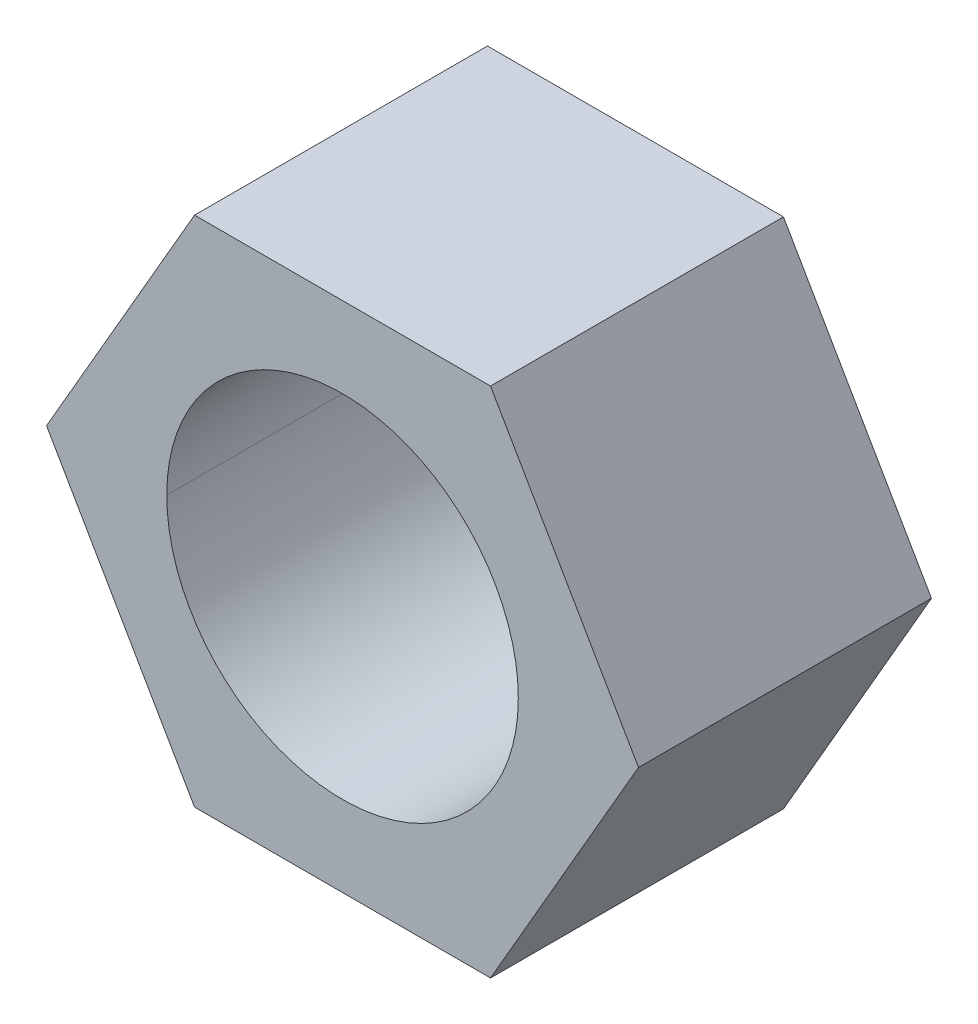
ISO-10303-21;
HEADER;
FILE_DESCRIPTION(('STEP AP214'),'2;1');
FILE_NAME('part.step','',(''),(''),'','','');
FILE_SCHEMA(('AUTOMOTIVE_DESIGN { 1 0 10303 214 1 1 1 1 }'));
ENDSEC;
DATA;
#1=APPLICATION_CONTEXT('core data for automotive mechanical design processes');
#2=APPLICATION_PROTOCOL_DEFINITION('international standard','automotive_design',2000,#1);
#3=PRODUCT_CONTEXT('',#1,'mechanical');
#4=PRODUCT('Part','Part','',(#3));
#5=PRODUCT_RELATED_PRODUCT_CATEGORY('part','',(#4));
#6=PRODUCT_DEFINITION_FORMATION('','',#4);
#7=PRODUCT_DEFINITION_CONTEXT('part definition',#1,'design');
#8=PRODUCT_DEFINITION('design','',#6,#7);
#9=PRODUCT_DEFINITION_SHAPE('','',#8);
#10=(LENGTH_UNIT() NAMED_UNIT(*) SI_UNIT(.MILLI.,.METRE.));
#11=(NAMED_UNIT(*) PLANE_ANGLE_UNIT() SI_UNIT($,.RADIAN.));
#12=(NAMED_UNIT(*) SI_UNIT($,.STERADIAN.) SOLID_ANGLE_UNIT());
#13=UNCERTAINTY_MEASURE_WITH_UNIT(LENGTH_MEASURE(1.E-05),#10,'distance_accuracy_value','');
#14=(GEOMETRIC_REPRESENTATION_CONTEXT(3) GLOBAL_UNCERTAINTY_ASSIGNED_CONTEXT((#13)) GLOBAL_UNIT_ASSIGNED_CONTEXT((#10,
#11,#12)) REPRESENTATION_CONTEXT('',''));
#15=CARTESIAN_POINT('',(0.,0.,0.));
#16=DIRECTION('',(0.,0.,1.));
#17=DIRECTION('',(1.,0.,0.));
#18=AXIS2_PLACEMENT_3D('',#15,#16,#17);
#19=CARTESIAN_POINT('',(-32.0790243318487,0.,-15.875));
#20=DIRECTION('',(-0.866025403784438,0.500000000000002,0.));
#21=DIRECTION('',(-0.500000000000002,-0.866025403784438,0.));
#22=AXIS2_PLACEMENT_3D('',#19,#20,#21);
#23=PLANE('',#22);
#24=DIRECTION('',(0.500000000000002,0.866025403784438,0.));
#25=VECTOR('',#24,1.);
#26=CARTESIAN_POINT('',(-32.0790243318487,0.,-15.875));
#27=LINE('',#26,#25);
#28=CARTESIAN_POINT('',(-32.0790243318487,0.,-15.875));
#29=VERTEX_POINT('',#28);
#30=CARTESIAN_POINT('',(-16.0395121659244,27.78125,-15.875));
#31=VERTEX_POINT('',#30);
#32=EDGE_CURVE('E109',#29,#31,#27,.T.);
#33=ORIENTED_EDGE('',*,*,#32,.F.);
#34=DIRECTION('',(0.,0.,1.));
#35=VECTOR('',#34,1.);
#36=CARTESIAN_POINT('',(-32.0790243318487,0.,-15.875));
#37=LINE('',#36,#35);
#38=CARTESIAN_POINT('',(-32.0790243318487,0.,15.875));
#39=VERTEX_POINT('',#38);
#40=EDGE_CURVE('E98',#39,#29,#37,.F.);
#41=ORIENTED_EDGE('',*,*,#40,.F.);
#42=DIRECTION('',(0.500000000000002,0.866025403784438,0.));
#43=VECTOR('',#42,1.);
#44=CARTESIAN_POINT('',(-32.0790243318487,0.,15.875));
#45=LINE('',#44,#43);
#46=CARTESIAN_POINT('',(-16.0395121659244,27.78125,15.875));
#47=VERTEX_POINT('',#46);
#48=EDGE_CURVE('E117',#39,#47,#45,.T.);
#49=ORIENTED_EDGE('',*,*,#48,.T.);
#50=DIRECTION('',(0.,0.,1.));
#51=VECTOR('',#50,1.);
#52=CARTESIAN_POINT('',(-16.0395121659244,27.78125,-15.875));
#53=LINE('',#52,#51);
#54=EDGE_CURVE('E135',#31,#47,#53,.T.);
#55=ORIENTED_EDGE('',*,*,#54,.F.);
#56=EDGE_LOOP('',(#33,#41,#49,#55));
#57=FACE_BOUND('',#56,.T.);
#58=ADVANCED_FACE('F16',(#57),#23,.T.);
#59=CARTESIAN_POINT('',(-16.0395121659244,27.78125,-15.875));
#60=DIRECTION('',(0.,1.,0.));
#61=DIRECTION('',(0.,0.,1.));
#62=AXIS2_PLACEMENT_3D('',#59,#60,#61);
#63=PLANE('',#62);
#64=DIRECTION('',(-1.,0.,0.));
#65=VECTOR('',#64,1.);
#66=CARTESIAN_POINT('',(-7.21911419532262E-13,27.78125,-15.875));
#67=LINE('',#66,#65);
#68=CARTESIAN_POINT('',(16.0395121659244,27.78125,-15.875));
#69=VERTEX_POINT('',#68);
#70=EDGE_CURVE('E107',#31,#69,#67,.F.);
#71=ORIENTED_EDGE('',*,*,#70,.F.);
#72=ORIENTED_EDGE('',*,*,#54,.T.);
#73=DIRECTION('',(-1.,0.,0.));
#74=VECTOR('',#73,1.);
#75=CARTESIAN_POINT('',(-16.0395121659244,27.78125,15.875));
#76=LINE('',#75,#74);
#77=CARTESIAN_POINT('',(16.0395121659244,27.78125,15.875));
#78=VERTEX_POINT('',#77);
#79=EDGE_CURVE('E111',#47,#78,#76,.F.);
#80=ORIENTED_EDGE('',*,*,#79,.T.);
#81=DIRECTION('',(0.,0.,1.));
#82=VECTOR('',#81,1.);
#83=CARTESIAN_POINT('',(16.0395121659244,27.78125,-15.875));
#84=LINE('',#83,#82);
#85=EDGE_CURVE('E133',#69,#78,#84,.T.);
#86=ORIENTED_EDGE('',*,*,#85,.F.);
#87=EDGE_LOOP('',(#71,#72,#80,#86));
#88=FACE_BOUND('',#87,.T.);
#89=ADVANCED_FACE('F205',(#88),#63,.T.);
#90=CARTESIAN_POINT('',(16.0395121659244,27.78125,-15.875));
#91=DIRECTION('',(0.866025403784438,0.500000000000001,0.));
#92=DIRECTION('',(-0.500000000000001,0.866025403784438,0.));
#93=AXIS2_PLACEMENT_3D('',#90,#91,#92);
#94=PLANE('',#93);
#95=DIRECTION('',(0.500000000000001,-0.866025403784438,0.));
#96=VECTOR('',#95,1.);
#97=CARTESIAN_POINT('',(16.0395121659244,27.78125,-15.875));
#98=LINE('',#97,#96);
#99=CARTESIAN_POINT('',(32.0790243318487,0.,-15.875));
#100=VERTEX_POINT('',#99);
#101=EDGE_CURVE('E105',#69,#100,#98,.T.);
#102=ORIENTED_EDGE('',*,*,#101,.F.);
#103=ORIENTED_EDGE('',*,*,#85,.T.);
#104=DIRECTION('',(0.500000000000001,-0.866025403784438,0.));
#105=VECTOR('',#104,1.);
#106=CARTESIAN_POINT('',(16.0395121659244,27.78125,15.875));
#107=LINE('',#106,#105);
#108=CARTESIAN_POINT('',(32.0790243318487,0.,15.875));
#109=VERTEX_POINT('',#108);
#110=EDGE_CURVE('E97',#78,#109,#107,.T.);
#111=ORIENTED_EDGE('',*,*,#110,.T.);
#112=DIRECTION('',(0.,0.,1.));
#113=VECTOR('',#112,1.);
#114=CARTESIAN_POINT('',(32.0790243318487,0.,-15.875));
#115=LINE('',#114,#113);
#116=EDGE_CURVE('E131',#100,#109,#115,.T.);
#117=ORIENTED_EDGE('',*,*,#116,.F.);
#118=EDGE_LOOP('',(#102,#103,#111,#117));
#119=FACE_BOUND('',#118,.T.);
#120=ADVANCED_FACE('F197',(#119),#94,.T.);
#121=CARTESIAN_POINT('',(32.0790243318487,0.,-15.875));
#122=DIRECTION('',(0.866025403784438,-0.500000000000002,0.));
#123=DIRECTION('',(0.500000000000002,0.866025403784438,0.));
#124=AXIS2_PLACEMENT_3D('',#121,#122,#123);
#125=PLANE('',#124);
#126=DIRECTION('',(-0.500000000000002,-0.866025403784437,0.));
#127=VECTOR('',#126,1.);
#128=CARTESIAN_POINT('',(32.0790243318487,0.,-15.875));
#129=LINE('',#128,#127);
#130=CARTESIAN_POINT('',(16.0395121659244,-27.78125,-15.875));
#131=VERTEX_POINT('',#130);
#132=EDGE_CURVE('E85',#100,#131,#129,.T.);
#133=ORIENTED_EDGE('',*,*,#132,.F.);
#134=ORIENTED_EDGE('',*,*,#116,.T.);
#135=DIRECTION('',(-0.500000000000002,-0.866025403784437,0.));
#136=VECTOR('',#135,1.);
#137=CARTESIAN_POINT('',(32.0790243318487,0.,15.875));
#138=LINE('',#137,#136);
#139=CARTESIAN_POINT('',(16.0395121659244,-27.78125,15.875));
#140=VERTEX_POINT('',#139);
#141=EDGE_CURVE('E123',#109,#140,#138,.T.);
#142=ORIENTED_EDGE('',*,*,#141,.T.);
#143=DIRECTION('',(0.,0.,1.));
#144=VECTOR('',#143,1.);
#145=CARTESIAN_POINT('',(16.0395121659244,-27.78125,-15.875));
#146=LINE('',#145,#144);
#147=EDGE_CURVE('E129',#131,#140,#146,.T.);
#148=ORIENTED_EDGE('',*,*,#147,.F.);
#149=EDGE_LOOP('',(#133,#134,#142,#148));
#150=FACE_BOUND('',#149,.T.);
#151=ADVANCED_FACE('F190',(#150),#125,.T.);
#152=CARTESIAN_POINT('',(16.0395121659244,-27.78125,-15.875));
#153=DIRECTION('',(0.,-1.,0.));
#154=DIRECTION('',(1.,0.,0.));
#155=AXIS2_PLACEMENT_3D('',#152,#153,#154);
#156=PLANE('',#155);
#157=DIRECTION('',(-1.,0.,0.));
#158=VECTOR('',#157,1.);
#159=CARTESIAN_POINT('',(-7.21911419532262E-13,-27.78125,-15.875));
#160=LINE('',#159,#158);
#161=CARTESIAN_POINT('',(-16.0395121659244,-27.78125,-15.875));
#162=VERTEX_POINT('',#161);
#163=EDGE_CURVE('E77',#131,#162,#160,.T.);
#164=ORIENTED_EDGE('',*,*,#163,.F.);
#165=ORIENTED_EDGE('',*,*,#147,.T.);
#166=DIRECTION('',(-1.,0.,0.));
#167=VECTOR('',#166,1.);
#168=CARTESIAN_POINT('',(-16.0395121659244,-27.78125,15.875));
#169=LINE('',#168,#167);
#170=CARTESIAN_POINT('',(-16.0395121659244,-27.78125,15.875));
#171=VERTEX_POINT('',#170);
#172=EDGE_CURVE('E93',#140,#171,#169,.T.);
#173=ORIENTED_EDGE('',*,*,#172,.T.);
#174=DIRECTION('',(0.,0.,1.));
#175=VECTOR('',#174,1.);
#176=CARTESIAN_POINT('',(-16.0395121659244,-27.78125,-15.875));
#177=LINE('',#176,#175);
#178=EDGE_CURVE('E90',#162,#171,#177,.T.);
#179=ORIENTED_EDGE('',*,*,#178,.F.);
#180=EDGE_LOOP('',(#164,#165,#173,#179));
#181=FACE_BOUND('',#180,.T.);
#182=ADVANCED_FACE('F91',(#181),#156,.T.);
#183=CARTESIAN_POINT('',(-16.0395121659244,-27.78125,-15.875));
#184=DIRECTION('',(-0.866025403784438,-0.500000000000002,0.));
#185=DIRECTION('',(0.500000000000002,-0.866025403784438,0.));
#186=AXIS2_PLACEMENT_3D('',#183,#184,#185);
#187=PLANE('',#186);
#188=DIRECTION('',(-0.500000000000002,0.866025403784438,0.));
#189=VECTOR('',#188,1.);
#190=CARTESIAN_POINT('',(-16.0395121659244,-27.78125,-15.875));
#191=LINE('',#190,#189);
#192=EDGE_CURVE('E82',#162,#29,#191,.T.);
#193=ORIENTED_EDGE('',*,*,#192,.F.);
#194=ORIENTED_EDGE('',*,*,#178,.T.);
#195=DIRECTION('',(-0.500000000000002,0.866025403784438,0.));
#196=VECTOR('',#195,1.);
#197=CARTESIAN_POINT('',(-16.0395121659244,-27.78125,15.875));
#198=LINE('',#197,#196);
#199=EDGE_CURVE('E120',#171,#39,#198,.T.);
#200=ORIENTED_EDGE('',*,*,#199,.T.);
#201=ORIENTED_EDGE('',*,*,#40,.T.);
#202=EDGE_LOOP('',(#193,#194,#200,#201));
#203=FACE_BOUND('',#202,.T.);
#204=ADVANCED_FACE('F100',(#203),#187,.T.);
#205=CARTESIAN_POINT('',(-16.0395121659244,27.78125,15.875));
#206=DIRECTION('',(0.,0.,-1.));
#207=DIRECTION('',(-1.,0.,0.));
#208=AXIS2_PLACEMENT_3D('',#205,#206,#207);
#209=PLANE('',#208);
#210=ORIENTED_EDGE('',*,*,#48,.F.);
#211=ORIENTED_EDGE('',*,*,#199,.F.);
#212=ORIENTED_EDGE('',*,*,#172,.F.);
#213=ORIENTED_EDGE('',*,*,#141,.F.);
#214=ORIENTED_EDGE('',*,*,#110,.F.);
#215=ORIENTED_EDGE('',*,*,#79,.F.);
#216=EDGE_LOOP('',(#210,#211,#212,#213,#214,#215));
#217=FACE_BOUND('',#216,.T.);
#218=CARTESIAN_POINT('',(0.,1.80477854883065E-13,15.875));
#219=DIRECTION('',(0.,0.,1.));
#220=DIRECTION('',(1.,0.,0.));
#221=AXIS2_PLACEMENT_3D('',#218,#219,#220);
#222=CIRCLE('',#221,19.05);
#223=CARTESIAN_POINT('',(19.05,1.78144979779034E-13,15.875));
#224=VERTEX_POINT('',#223);
#225=CARTESIAN_POINT('',(-19.05,0.,15.875));
#226=VERTEX_POINT('',#225);
#227=EDGE_CURVE('E113',#224,#226,#222,.F.);
#228=ORIENTED_EDGE('',*,*,#227,.T.);
#229=CARTESIAN_POINT('',(0.,1.80477854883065E-13,15.875));
#230=DIRECTION('',(0.,0.,1.));
#231=DIRECTION('',(1.,0.,0.));
#232=AXIS2_PLACEMENT_3D('',#229,#230,#231);
#233=CIRCLE('',#232,19.05);
#234=EDGE_CURVE('E102',#226,#224,#233,.F.);
#235=ORIENTED_EDGE('',*,*,#234,.T.);
#236=EDGE_LOOP('',(#228,#235));
#237=FACE_BOUND('',#236,.T.);
#238=ADVANCED_FACE('F142',(#217,#237),#209,.F.);
#239=CARTESIAN_POINT('',(-7.21911419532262E-13,0.,-15.875));
#240=DIRECTION('',(0.,0.,-1.));
#241=DIRECTION('',(-1.,0.,0.));
#242=AXIS2_PLACEMENT_3D('',#239,#240,#241);
#243=PLANE('',#242);
#244=ORIENTED_EDGE('',*,*,#163,.T.);
#245=ORIENTED_EDGE('',*,*,#192,.T.);
#246=ORIENTED_EDGE('',*,*,#32,.T.);
#247=ORIENTED_EDGE('',*,*,#70,.T.);
#248=ORIENTED_EDGE('',*,*,#101,.T.);
#249=ORIENTED_EDGE('',*,*,#132,.T.);
#250=EDGE_LOOP('',(#244,#245,#246,#247,#248,#249));
#251=FACE_BOUND('',#250,.T.);
#252=CARTESIAN_POINT('',(0.,1.80477854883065E-13,-15.875));
#253=DIRECTION('',(0.,0.,1.));
#254=DIRECTION('',(1.,0.,0.));
#255=AXIS2_PLACEMENT_3D('',#252,#253,#254);
#256=CIRCLE('',#255,19.05);
#257=CARTESIAN_POINT('',(-19.05,1.82810729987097E-13,-15.875));
#258=VERTEX_POINT('',#257);
#259=CARTESIAN_POINT('',(19.05,1.80477854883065E-13,-15.875));
#260=VERTEX_POINT('',#259);
#261=EDGE_CURVE('E25',#258,#260,#256,.T.);
#262=ORIENTED_EDGE('',*,*,#261,.T.);
#263=CARTESIAN_POINT('',(0.,1.80477854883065E-13,-15.875));
#264=DIRECTION('',(0.,0.,1.));
#265=DIRECTION('',(1.,0.,0.));
#266=AXIS2_PLACEMENT_3D('',#263,#264,#265);
#267=CIRCLE('',#266,19.05);
#268=EDGE_CURVE('E19',#260,#258,#267,.T.);
#269=ORIENTED_EDGE('',*,*,#268,.T.);
#270=EDGE_LOOP('',(#262,#269));
#271=FACE_BOUND('',#270,.T.);
#272=ADVANCED_FACE('F79',(#251,#271),#243,.T.);
#273=CARTESIAN_POINT('',(0.,1.80477854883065E-13,-97.3039813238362));
#274=DIRECTION('',(0.,0.,1.));
#275=DIRECTION('',(1.,0.,0.));
#276=AXIS2_PLACEMENT_3D('',#273,#274,#275);
#277=CYLINDRICAL_SURFACE('',#276,19.05);
#278=ORIENTED_EDGE('',*,*,#234,.F.);
#279=DIRECTION('',(0.,0.,1.));
#280=VECTOR('',#279,1.);
#281=CARTESIAN_POINT('',(-19.05,0.,-97.3039813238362));
#282=LINE('',#281,#280);
#283=EDGE_CURVE('E112',#226,#258,#282,.F.);
#284=ORIENTED_EDGE('',*,*,#283,.T.);
#285=ORIENTED_EDGE('',*,*,#268,.F.);
#286=DIRECTION('',(0.,0.,1.));
#287=VECTOR('',#286,1.);
#288=CARTESIAN_POINT('',(19.05,1.80477854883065E-13,-97.3039813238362));
#289=LINE('',#288,#287);
#290=EDGE_CURVE('E11',#260,#224,#289,.T.);
#291=ORIENTED_EDGE('',*,*,#290,.T.);
#292=EDGE_LOOP('',(#278,#284,#285,#291));
#293=FACE_BOUND('',#292,.T.);
#294=ADVANCED_FACE('F144',(#293),#277,.F.);
#295=CARTESIAN_POINT('',(0.,1.80477854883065E-13,-97.3039813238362));
#296=DIRECTION('',(0.,0.,1.));
#297=DIRECTION('',(1.,0.,0.));
#298=AXIS2_PLACEMENT_3D('',#295,#296,#297);
#299=CYLINDRICAL_SURFACE('',#298,19.05);
#300=ORIENTED_EDGE('',*,*,#261,.F.);
#301=ORIENTED_EDGE('',*,*,#283,.F.);
#302=ORIENTED_EDGE('',*,*,#227,.F.);
#303=ORIENTED_EDGE('',*,*,#290,.F.);
#304=EDGE_LOOP('',(#300,#301,#302,#303));
#305=FACE_BOUND('',#304,.T.);
#306=ADVANCED_FACE('F147',(#305),#299,.F.);
#307=CLOSED_SHELL('',(#58,#89,#120,#151,#182,#204,#238,#272,#294,#306));
#308=MANIFOLD_SOLID_BREP('B1',#307);
#309=ADVANCED_BREP_SHAPE_REPRESENTATION('',(#18,#308),#14);
#310=SHAPE_DEFINITION_REPRESENTATION(#9,#309);
ENDSEC;
END-ISO-10303-21;
